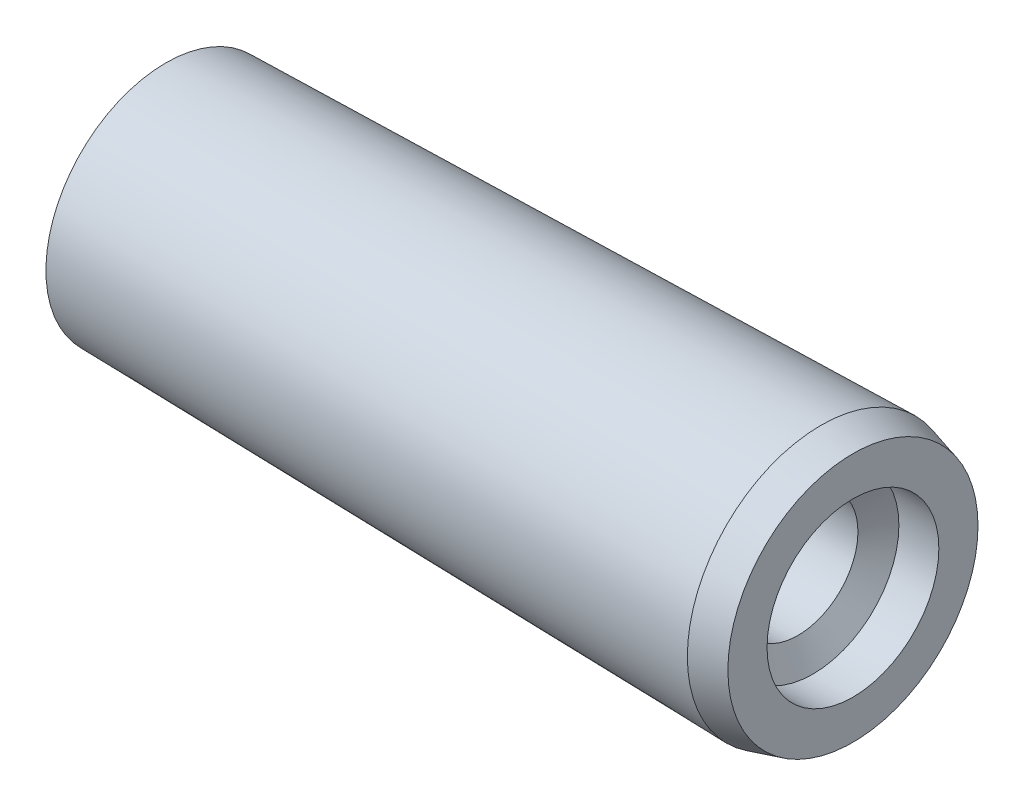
from build123d import *


with BuildPart() as part:
    # Sketch1 → Body (revolve)
    with BuildSketch(Plane.XY, mode=Mode.PRIVATE) as body_sk:
        with BuildLine():
            Line((18, 0), (18, 3.129640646))
            Line((18, 3.129640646), (17.2, 3.344))
            Line((17.2, 3.344), (0.803847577, 3))
            ThreePointArc((0.803847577, 3), (0.204445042, 1.552914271), (0, 0))
            Line((0, 0), (18, 0))
        make_face()
    revolve(body_sk.sketch.rotate(Axis((18, 0, 0), (-1, 0, 0)), 90), axis=Axis((18, 0, 0), (-1, 0, 0)))

    # Sketch2 → Hole (revolve, cut)
    with BuildSketch(Plane.XY):
        Polygon((18, 0), (18, 2.15), (17, 2.15), (16.624722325, 1.5), (8, 1.5), (7.133974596, 0), align=None)
    revolve(axis=Axis((18, 0, 0), (-1, 0, 0)), mode=Mode.SUBTRACT)


solid = part.part
